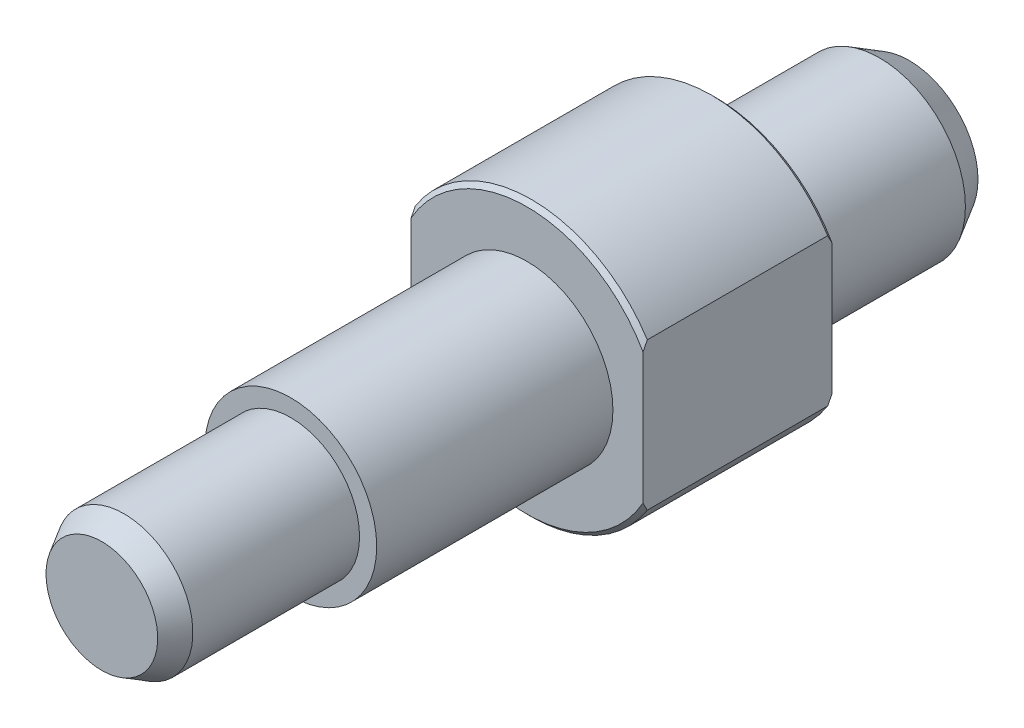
ISO-10303-21;
HEADER;
FILE_DESCRIPTION(('STEP AP214'),'2;1');
FILE_NAME('part.step','',(''),(''),'','','');
FILE_SCHEMA(('AUTOMOTIVE_DESIGN { 1 0 10303 214 1 1 1 1 }'));
ENDSEC;
DATA;
#1=APPLICATION_CONTEXT('core data for automotive mechanical design processes');
#2=APPLICATION_PROTOCOL_DEFINITION('international standard','automotive_design',2000,#1);
#3=PRODUCT_CONTEXT('',#1,'mechanical');
#4=PRODUCT('Part','Part','',(#3));
#5=PRODUCT_RELATED_PRODUCT_CATEGORY('part','',(#4));
#6=PRODUCT_DEFINITION_FORMATION('','',#4);
#7=PRODUCT_DEFINITION_CONTEXT('part definition',#1,'design');
#8=PRODUCT_DEFINITION('design','',#6,#7);
#9=PRODUCT_DEFINITION_SHAPE('','',#8);
#10=(LENGTH_UNIT() NAMED_UNIT(*) SI_UNIT(.MILLI.,.METRE.));
#11=(NAMED_UNIT(*) PLANE_ANGLE_UNIT() SI_UNIT($,.RADIAN.));
#12=(NAMED_UNIT(*) SI_UNIT($,.STERADIAN.) SOLID_ANGLE_UNIT());
#13=UNCERTAINTY_MEASURE_WITH_UNIT(LENGTH_MEASURE(1.E-05),#10,'distance_accuracy_value','');
#14=(GEOMETRIC_REPRESENTATION_CONTEXT(3) GLOBAL_UNCERTAINTY_ASSIGNED_CONTEXT((#13)) GLOBAL_UNIT_ASSIGNED_CONTEXT((#10,
#11,#12)) REPRESENTATION_CONTEXT('',''));
#15=CARTESIAN_POINT('',(0.,0.,0.));
#16=DIRECTION('',(0.,0.,1.));
#17=DIRECTION('',(1.,0.,0.));
#18=AXIS2_PLACEMENT_3D('',#15,#16,#17);
#19=CARTESIAN_POINT('',(0.,0.,0.));
#20=DIRECTION('',(0.,0.,1.));
#21=DIRECTION('',(1.,0.,0.));
#22=AXIS2_PLACEMENT_3D('',#19,#20,#21);
#23=PLANE('',#22);
#24=CARTESIAN_POINT('',(0.,0.,0.));
#25=DIRECTION('',(0.,0.,1.));
#26=DIRECTION('',(1.,0.,0.));
#27=AXIS2_PLACEMENT_3D('',#24,#25,#26);
#28=CIRCLE('',#27,10.);
#29=CARTESIAN_POINT('',(10.,0.,0.));
#30=VERTEX_POINT('',#29);
#31=EDGE_CURVE('E204',#30,#30,#28,.T.);
#32=ORIENTED_EDGE('',*,*,#31,.T.);
#33=EDGE_LOOP('',(#32));
#34=FACE_BOUND('',#33,.T.);
#35=DIRECTION('',(0.,1.,0.));
#36=VECTOR('',#35,1.);
#37=CARTESIAN_POINT('',(13.5,0.,0.));
#38=LINE('',#37,#36);
#39=CARTESIAN_POINT('',(13.5,-7.61577310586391,0.));
#40=VERTEX_POINT('',#39);
#41=CARTESIAN_POINT('',(13.5,7.61577310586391,0.));
#42=VERTEX_POINT('',#41);
#43=EDGE_CURVE('E211',#40,#42,#38,.T.);
#44=ORIENTED_EDGE('',*,*,#43,.F.);
#45=CARTESIAN_POINT('',(0.,0.,0.));
#46=DIRECTION('',(0.,0.,1.));
#47=DIRECTION('',(1.,0.,0.));
#48=AXIS2_PLACEMENT_3D('',#45,#46,#47);
#49=CIRCLE('',#48,15.5);
#50=CARTESIAN_POINT('',(-13.5,-7.61577310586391,0.));
#51=VERTEX_POINT('',#50);
#52=EDGE_CURVE('E401',#40,#51,#49,.F.);
#53=ORIENTED_EDGE('',*,*,#52,.T.);
#54=DIRECTION('',(0.,-1.,0.));
#55=VECTOR('',#54,1.);
#56=CARTESIAN_POINT('',(-13.5,0.,0.));
#57=LINE('',#56,#55);
#58=CARTESIAN_POINT('',(-13.5,7.61577310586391,0.));
#59=VERTEX_POINT('',#58);
#60=EDGE_CURVE('E87',#59,#51,#57,.T.);
#61=ORIENTED_EDGE('',*,*,#60,.F.);
#62=CARTESIAN_POINT('',(0.,0.,0.));
#63=DIRECTION('',(0.,0.,1.));
#64=DIRECTION('',(1.,0.,0.));
#65=AXIS2_PLACEMENT_3D('',#62,#63,#64);
#66=CIRCLE('',#65,15.5);
#67=EDGE_CURVE('E399',#59,#42,#66,.F.);
#68=ORIENTED_EDGE('',*,*,#67,.T.);
#69=EDGE_LOOP('',(#44,#53,#61,#68));
#70=FACE_BOUND('',#69,.T.);
#71=ADVANCED_FACE('F14',(#34,#70),#23,.F.);
#72=CARTESIAN_POINT('',(0.,0.,22.));
#73=DIRECTION('',(0.,0.,-1.));
#74=DIRECTION('',(-1.,0.,0.));
#75=AXIS2_PLACEMENT_3D('',#72,#73,#74);
#76=CYLINDRICAL_SURFACE('',#75,16.);
#77=DIRECTION('',(0.,0.,-1.));
#78=VECTOR('',#77,1.);
#79=CARTESIAN_POINT('',(13.5,8.58778201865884,22.));
#80=LINE('',#79,#78);
#81=CARTESIAN_POINT('',(13.5,8.58778201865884,0.5));
#82=VERTEX_POINT('',#81);
#83=CARTESIAN_POINT('',(13.5,8.58778201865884,21.5));
#84=VERTEX_POINT('',#83);
#85=EDGE_CURVE('E186',#82,#84,#80,.F.);
#86=ORIENTED_EDGE('',*,*,#85,.F.);
#87=CARTESIAN_POINT('',(0.,0.,0.5));
#88=DIRECTION('',(0.,0.,1.));
#89=DIRECTION('',(1.,0.,0.));
#90=AXIS2_PLACEMENT_3D('',#87,#88,#89);
#91=CIRCLE('',#90,16.);
#92=CARTESIAN_POINT('',(-13.5,8.58778201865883,0.5));
#93=VERTEX_POINT('',#92);
#94=EDGE_CURVE('E9',#82,#93,#91,.T.);
#95=ORIENTED_EDGE('',*,*,#94,.T.);
#96=DIRECTION('',(0.,0.,-1.));
#97=VECTOR('',#96,1.);
#98=CARTESIAN_POINT('',(-13.5,8.58778201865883,22.));
#99=LINE('',#98,#97);
#100=CARTESIAN_POINT('',(-13.5,8.58778201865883,21.5));
#101=VERTEX_POINT('',#100);
#102=EDGE_CURVE('E102',#101,#93,#99,.T.);
#103=ORIENTED_EDGE('',*,*,#102,.F.);
#104=CARTESIAN_POINT('',(0.,0.,21.5));
#105=DIRECTION('',(0.,0.,1.));
#106=DIRECTION('',(1.,0.,0.));
#107=AXIS2_PLACEMENT_3D('',#104,#105,#106);
#108=CIRCLE('',#107,16.);
#109=EDGE_CURVE('E23',#101,#84,#108,.F.);
#110=ORIENTED_EDGE('',*,*,#109,.T.);
#111=EDGE_LOOP('',(#86,#95,#103,#110));
#112=FACE_BOUND('',#111,.T.);
#113=ADVANCED_FACE('F185',(#112),#76,.T.);
#114=DIRECTION('',(0.,0.,-1.));
#115=VECTOR('',#114,1.);
#116=CARTESIAN_POINT('',(-13.5,-8.58778201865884,22.));
#117=LINE('',#116,#115);
#118=CARTESIAN_POINT('',(-13.5,-8.58778201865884,0.5));
#119=VERTEX_POINT('',#118);
#120=CARTESIAN_POINT('',(-13.5,-8.58778201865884,21.5));
#121=VERTEX_POINT('',#120);
#122=EDGE_CURVE('E84',#119,#121,#117,.F.);
#123=ORIENTED_EDGE('',*,*,#122,.F.);
#124=CARTESIAN_POINT('',(0.,0.,0.5));
#125=DIRECTION('',(0.,0.,1.));
#126=DIRECTION('',(1.,0.,0.));
#127=AXIS2_PLACEMENT_3D('',#124,#125,#126);
#128=CIRCLE('',#127,16.);
#129=CARTESIAN_POINT('',(13.5,-8.58778201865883,0.5));
#130=VERTEX_POINT('',#129);
#131=EDGE_CURVE('E98',#119,#130,#128,.T.);
#132=ORIENTED_EDGE('',*,*,#131,.T.);
#133=DIRECTION('',(0.,0.,-1.));
#134=VECTOR('',#133,1.);
#135=CARTESIAN_POINT('',(13.5,-8.58778201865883,22.));
#136=LINE('',#135,#134);
#137=CARTESIAN_POINT('',(13.5,-8.58778201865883,21.5));
#138=VERTEX_POINT('',#137);
#139=EDGE_CURVE('E193',#138,#130,#136,.T.);
#140=ORIENTED_EDGE('',*,*,#139,.F.);
#141=CARTESIAN_POINT('',(0.,0.,21.5));
#142=DIRECTION('',(0.,0.,1.));
#143=DIRECTION('',(1.,0.,0.));
#144=AXIS2_PLACEMENT_3D('',#141,#142,#143);
#145=CIRCLE('',#144,16.);
#146=EDGE_CURVE('E101',#138,#121,#145,.F.);
#147=ORIENTED_EDGE('',*,*,#146,.T.);
#148=EDGE_LOOP('',(#123,#132,#140,#147));
#149=FACE_BOUND('',#148,.T.);
#150=ADVANCED_FACE('F96',(#149),#76,.T.);
#151=CARTESIAN_POINT('',(0.,0.,22.));
#152=DIRECTION('',(0.,0.,1.));
#153=DIRECTION('',(1.,0.,0.));
#154=AXIS2_PLACEMENT_3D('',#151,#152,#153);
#155=PLANE('',#154);
#156=CARTESIAN_POINT('',(0.,0.,22.));
#157=DIRECTION('',(0.,0.,1.));
#158=DIRECTION('',(1.,0.,0.));
#159=AXIS2_PLACEMENT_3D('',#156,#157,#158);
#160=CIRCLE('',#159,10.);
#161=CARTESIAN_POINT('',(10.,0.,22.));
#162=VERTEX_POINT('',#161);
#163=EDGE_CURVE('E207',#162,#162,#160,.T.);
#164=ORIENTED_EDGE('',*,*,#163,.F.);
#165=EDGE_LOOP('',(#164));
#166=FACE_BOUND('',#165,.T.);
#167=DIRECTION('',(0.,-1.,0.));
#168=VECTOR('',#167,1.);
#169=CARTESIAN_POINT('',(-13.5,0.,22.));
#170=LINE('',#169,#168);
#171=CARTESIAN_POINT('',(-13.5,7.61577310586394,22.));
#172=VERTEX_POINT('',#171);
#173=CARTESIAN_POINT('',(-13.5,-7.61577310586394,22.));
#174=VERTEX_POINT('',#173);
#175=EDGE_CURVE('E111',#172,#174,#170,.T.);
#176=ORIENTED_EDGE('',*,*,#175,.T.);
#177=CARTESIAN_POINT('',(0.,0.,22.));
#178=DIRECTION('',(0.,0.,1.));
#179=DIRECTION('',(1.,0.,0.));
#180=AXIS2_PLACEMENT_3D('',#177,#178,#179);
#181=CIRCLE('',#180,15.5);
#182=CARTESIAN_POINT('',(13.5,-7.61577310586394,22.));
#183=VERTEX_POINT('',#182);
#184=EDGE_CURVE('E179',#174,#183,#181,.T.);
#185=ORIENTED_EDGE('',*,*,#184,.T.);
#186=DIRECTION('',(0.,1.,0.));
#187=VECTOR('',#186,1.);
#188=CARTESIAN_POINT('',(13.5,0.,22.));
#189=LINE('',#188,#187);
#190=CARTESIAN_POINT('',(13.5,7.61577310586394,22.));
#191=VERTEX_POINT('',#190);
#192=EDGE_CURVE('E200',#183,#191,#189,.T.);
#193=ORIENTED_EDGE('',*,*,#192,.T.);
#194=CARTESIAN_POINT('',(0.,0.,22.));
#195=DIRECTION('',(0.,0.,1.));
#196=DIRECTION('',(1.,0.,0.));
#197=AXIS2_PLACEMENT_3D('',#194,#195,#196);
#198=CIRCLE('',#197,15.5);
#199=EDGE_CURVE('E91',#191,#172,#198,.T.);
#200=ORIENTED_EDGE('',*,*,#199,.T.);
#201=EDGE_LOOP('',(#176,#185,#193,#200));
#202=FACE_BOUND('',#201,.T.);
#203=ADVANCED_FACE('F198',(#166,#202),#155,.T.);
#204=CARTESIAN_POINT('',(0.,0.,0.));
#205=DIRECTION('',(0.,0.,-1.));
#206=DIRECTION('',(-1.,0.,0.));
#207=AXIS2_PLACEMENT_3D('',#204,#205,#206);
#208=CYLINDRICAL_SURFACE('',#207,10.);
#209=CARTESIAN_POINT('',(0.,0.,-19.0358983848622));
#210=DIRECTION('',(0.,0.,1.));
#211=DIRECTION('',(1.,0.,0.));
#212=AXIS2_PLACEMENT_3D('',#209,#210,#211);
#213=CIRCLE('',#212,10.);
#214=CARTESIAN_POINT('',(10.,0.,-19.0358983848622));
#215=VERTEX_POINT('',#214);
#216=EDGE_CURVE('E103',#215,#215,#213,.T.);
#217=ORIENTED_EDGE('',*,*,#216,.T.);
#218=EDGE_LOOP('',(#217));
#219=FACE_BOUND('',#218,.T.);
#220=ORIENTED_EDGE('',*,*,#31,.F.);
#221=EDGE_LOOP('',(#220));
#222=FACE_BOUND('',#221,.T.);
#223=ADVANCED_FACE('F257',(#219,#222),#208,.T.);
#224=CARTESIAN_POINT('',(0.,0.,49.5));
#225=DIRECTION('',(0.,0.,-1.));
#226=DIRECTION('',(-1.,0.,0.));
#227=AXIS2_PLACEMENT_3D('',#224,#225,#226);
#228=CYLINDRICAL_SURFACE('',#227,10.);
#229=CARTESIAN_POINT('',(0.,0.,49.5));
#230=DIRECTION('',(0.,0.,1.));
#231=DIRECTION('',(1.,0.,0.));
#232=AXIS2_PLACEMENT_3D('',#229,#230,#231);
#233=CIRCLE('',#232,10.);
#234=CARTESIAN_POINT('',(10.,0.,49.5));
#235=VERTEX_POINT('',#234);
#236=EDGE_CURVE('E208',#235,#235,#233,.T.);
#237=ORIENTED_EDGE('',*,*,#236,.F.);
#238=EDGE_LOOP('',(#237));
#239=FACE_BOUND('',#238,.T.);
#240=ORIENTED_EDGE('',*,*,#163,.T.);
#241=EDGE_LOOP('',(#240));
#242=FACE_BOUND('',#241,.T.);
#243=ADVANCED_FACE('F254',(#239,#242),#228,.T.);
#244=CARTESIAN_POINT('',(0.,0.,49.5));
#245=DIRECTION('',(0.,0.,1.));
#246=DIRECTION('',(1.,0.,0.));
#247=AXIS2_PLACEMENT_3D('',#244,#245,#246);
#248=PLANE('',#247);
#249=CARTESIAN_POINT('',(0.,0.,49.5));
#250=DIRECTION('',(0.,0.,1.));
#251=DIRECTION('',(1.,0.,0.));
#252=AXIS2_PLACEMENT_3D('',#249,#250,#251);
#253=CIRCLE('',#252,8.);
#254=CARTESIAN_POINT('',(8.,0.,49.5));
#255=VERTEX_POINT('',#254);
#256=EDGE_CURVE('E201',#255,#255,#253,.T.);
#257=ORIENTED_EDGE('',*,*,#256,.F.);
#258=EDGE_LOOP('',(#257));
#259=FACE_BOUND('',#258,.T.);
#260=ORIENTED_EDGE('',*,*,#236,.T.);
#261=EDGE_LOOP('',(#260));
#262=FACE_BOUND('',#261,.T.);
#263=ADVANCED_FACE('F265',(#259,#262),#248,.T.);
#264=CARTESIAN_POINT('',(0.,0.,71.5));
#265=DIRECTION('',(0.,0.,-1.));
#266=DIRECTION('',(-1.,0.,0.));
#267=AXIS2_PLACEMENT_3D('',#264,#265,#266);
#268=CYLINDRICAL_SURFACE('',#267,8.);
#269=CARTESIAN_POINT('',(0.,0.,68.9019237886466));
#270=DIRECTION('',(0.,0.,-1.));
#271=DIRECTION('',(-1.,0.,0.));
#272=AXIS2_PLACEMENT_3D('',#269,#270,#271);
#273=CIRCLE('',#272,8.);
#274=CARTESIAN_POINT('',(-8.,0.,68.9019237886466));
#275=VERTEX_POINT('',#274);
#276=EDGE_CURVE('E225',#275,#275,#273,.T.);
#277=ORIENTED_EDGE('',*,*,#276,.T.);
#278=EDGE_LOOP('',(#277));
#279=FACE_BOUND('',#278,.T.);
#280=ORIENTED_EDGE('',*,*,#256,.T.);
#281=EDGE_LOOP('',(#280));
#282=FACE_BOUND('',#281,.T.);
#283=ADVANCED_FACE('F130',(#279,#282),#268,.T.);
#284=CARTESIAN_POINT('',(13.5,17.8991869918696,71.5));
#285=DIRECTION('',(1.,0.,0.));
#286=DIRECTION('',(0.,1.,0.));
#287=AXIS2_PLACEMENT_3D('',#284,#285,#286);
#288=PLANE('',#287);
#289=ORIENTED_EDGE('',*,*,#139,.T.);
#290=CARTESIAN_POINT('',(13.5,-8.58778201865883,0.5));
#291=CARTESIAN_POINT('',(13.5,-8.50751562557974,0.456918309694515));
#292=CARTESIAN_POINT('',(13.5,-8.42706999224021,0.414170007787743));
#293=CARTESIAN_POINT('',(13.5,-8.2658189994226,0.329373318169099));
#294=CARTESIAN_POINT('',(13.5,-8.18501366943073,0.287324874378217));
#295=CARTESIAN_POINT('',(13.5,-8.02302878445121,0.203953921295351));
#296=CARTESIAN_POINT('',(13.5,-7.94184922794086,0.162631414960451));
#297=CARTESIAN_POINT('',(13.5,-7.77910228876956,0.0807409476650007));
#298=CARTESIAN_POINT('',(13.5,-7.69753487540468,0.040173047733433));
#299=CARTESIAN_POINT('',(13.5,-7.61577310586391,0.));
#300=B_SPLINE_CURVE_WITH_KNOTS('',3,(#290,#291,#292,#293,#294,#295,#296,#297,#298,#299),
.UNSPECIFIED.,.F.,.F.,(4,2,2,2,4),(0.,0.27329162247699,0.54656123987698,0.819831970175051,
1.0931247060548),.UNSPECIFIED.);
#301=EDGE_CURVE('E106',#130,#40,#300,.T.);
#302=ORIENTED_EDGE('',*,*,#301,.T.);
#303=ORIENTED_EDGE('',*,*,#43,.T.);
#304=CARTESIAN_POINT('',(13.5,7.61577310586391,0.));
#305=CARTESIAN_POINT('',(13.5,7.69753487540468,0.0401730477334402));
#306=CARTESIAN_POINT('',(13.5,7.77910228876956,0.0807409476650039));
#307=CARTESIAN_POINT('',(13.5,7.94184922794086,0.16263141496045));
#308=CARTESIAN_POINT('',(13.5,8.02302878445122,0.20395392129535));
#309=CARTESIAN_POINT('',(13.5,8.18501366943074,0.287324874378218));
#310=CARTESIAN_POINT('',(13.5,8.2658189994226,0.329373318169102));
#311=CARTESIAN_POINT('',(13.5,8.42706999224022,0.414170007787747));
#312=CARTESIAN_POINT('',(13.5,8.50751562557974,0.456918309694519));
#313=CARTESIAN_POINT('',(13.5,8.58778201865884,0.5));
#314=B_SPLINE_CURVE_WITH_KNOTS('',3,(#304,#305,#306,#307,#308,#309,#310,#311,#312,#313),
.UNSPECIFIED.,.F.,.F.,(4,2,2,2,4),(0.,0.27329273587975,0.546563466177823,0.819833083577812,
1.0931247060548),.UNSPECIFIED.);
#315=EDGE_CURVE('E109',#42,#82,#314,.T.);
#316=ORIENTED_EDGE('',*,*,#315,.T.);
#317=ORIENTED_EDGE('',*,*,#85,.T.);
#318=CARTESIAN_POINT('',(13.5,8.58778201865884,21.5));
#319=CARTESIAN_POINT('',(13.5,8.50751562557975,21.5430816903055));
#320=CARTESIAN_POINT('',(13.5,8.42706999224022,21.5858299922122));
#321=CARTESIAN_POINT('',(13.5,8.26581899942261,21.6706266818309));
#322=CARTESIAN_POINT('',(13.5,8.18501366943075,21.7126751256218));
#323=CARTESIAN_POINT('',(13.5,8.02302878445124,21.7960460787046));
#324=CARTESIAN_POINT('',(13.5,7.94184922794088,21.8373685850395));
#325=CARTESIAN_POINT('',(13.5,7.77910228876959,21.919259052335));
#326=CARTESIAN_POINT('',(13.5,7.69753487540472,21.9598269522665));
#327=CARTESIAN_POINT('',(13.5,7.61577310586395,22.));
#328=B_SPLINE_CURVE_WITH_KNOTS('',3,(#318,#319,#320,#321,#322,#323,#324,#325,#326,#327),
.UNSPECIFIED.,.F.,.F.,(4,2,2,2,4),(0.,0.273291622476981,0.546561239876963,0.819831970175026,
1.09312470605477),.UNSPECIFIED.);
#329=EDGE_CURVE('E107',#84,#191,#328,.T.);
#330=ORIENTED_EDGE('',*,*,#329,.T.);
#331=ORIENTED_EDGE('',*,*,#192,.F.);
#332=CARTESIAN_POINT('',(13.5,-7.61577310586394,22.));
#333=CARTESIAN_POINT('',(13.5,-7.69753487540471,21.9598269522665));
#334=CARTESIAN_POINT('',(13.5,-7.77910228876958,21.919259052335));
#335=CARTESIAN_POINT('',(13.5,-7.94184922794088,21.8373685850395));
#336=CARTESIAN_POINT('',(13.5,-8.02302878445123,21.7960460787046));
#337=CARTESIAN_POINT('',(13.5,-8.18501366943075,21.7126751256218));
#338=CARTESIAN_POINT('',(13.5,-8.26581899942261,21.6706266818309));
#339=CARTESIAN_POINT('',(13.5,-8.42706999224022,21.5858299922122));
#340=CARTESIAN_POINT('',(13.5,-8.50751562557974,21.5430816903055));
#341=CARTESIAN_POINT('',(13.5,-8.58778201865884,21.5));
#342=B_SPLINE_CURVE_WITH_KNOTS('',3,(#332,#333,#334,#335,#336,#337,#338,#339,#340,#341),
.UNSPECIFIED.,.F.,.F.,(4,2,2,2,4),(0.,0.273292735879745,0.546563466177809,0.819833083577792,
1.09312470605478),.UNSPECIFIED.);
#343=EDGE_CURVE('E140',#183,#138,#342,.T.);
#344=ORIENTED_EDGE('',*,*,#343,.T.);
#345=EDGE_LOOP('',(#289,#302,#303,#316,#317,#330,#331,#344));
#346=FACE_BOUND('',#345,.T.);
#347=ADVANCED_FACE('F125',(#346),#288,.T.);
#348=CARTESIAN_POINT('',(-13.5,17.8991869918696,71.5));
#349=DIRECTION('',(-1.,0.,0.));
#350=DIRECTION('',(0.,-1.,0.));
#351=AXIS2_PLACEMENT_3D('',#348,#349,#350);
#352=PLANE('',#351);
#353=ORIENTED_EDGE('',*,*,#60,.T.);
#354=CARTESIAN_POINT('',(-13.5,-7.61577310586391,0.));
#355=CARTESIAN_POINT('',(-13.5,-7.69753487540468,0.0401730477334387));
#356=CARTESIAN_POINT('',(-13.5,-7.77910228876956,0.0807409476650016));
#357=CARTESIAN_POINT('',(-13.5,-7.94184922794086,0.162631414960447));
#358=CARTESIAN_POINT('',(-13.5,-8.02302878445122,0.203953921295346));
#359=CARTESIAN_POINT('',(-13.5,-8.18501366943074,0.287324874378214));
#360=CARTESIAN_POINT('',(-13.5,-8.2658189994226,0.329373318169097));
#361=CARTESIAN_POINT('',(-13.5,-8.42706999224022,0.414170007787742));
#362=CARTESIAN_POINT('',(-13.5,-8.50751562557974,0.456918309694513));
#363=CARTESIAN_POINT('',(-13.5,-8.58778201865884,0.499999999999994));
#364=B_SPLINE_CURVE_WITH_KNOTS('',3,(#354,#355,#356,#357,#358,#359,#360,#361,#362,#363),
.UNSPECIFIED.,.F.,.F.,(4,2,2,2,4),(0.,0.273292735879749,0.546563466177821,0.81983308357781,
1.0931247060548),.UNSPECIFIED.);
#365=EDGE_CURVE('E81',#51,#119,#364,.T.);
#366=ORIENTED_EDGE('',*,*,#365,.T.);
#367=ORIENTED_EDGE('',*,*,#122,.T.);
#368=CARTESIAN_POINT('',(-13.5,-8.58778201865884,21.5));
#369=CARTESIAN_POINT('',(-13.5,-8.50751562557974,21.5430816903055));
#370=CARTESIAN_POINT('',(-13.5,-8.42706999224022,21.5858299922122));
#371=CARTESIAN_POINT('',(-13.5,-8.26581899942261,21.6706266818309));
#372=CARTESIAN_POINT('',(-13.5,-8.18501366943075,21.7126751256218));
#373=CARTESIAN_POINT('',(-13.5,-8.02302878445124,21.7960460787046));
#374=CARTESIAN_POINT('',(-13.5,-7.94184922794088,21.8373685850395));
#375=CARTESIAN_POINT('',(-13.5,-7.77910228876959,21.919259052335));
#376=CARTESIAN_POINT('',(-13.5,-7.69753487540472,21.9598269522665));
#377=CARTESIAN_POINT('',(-13.5,-7.61577310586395,22.));
#378=B_SPLINE_CURVE_WITH_KNOTS('',3,(#368,#369,#370,#371,#372,#373,#374,#375,#376,#377),
.UNSPECIFIED.,.F.,.F.,(4,2,2,2,4),(0.,0.273291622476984,0.546561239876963,0.819831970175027,
1.09312470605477),.UNSPECIFIED.);
#379=EDGE_CURVE('E92',#121,#174,#378,.T.);
#380=ORIENTED_EDGE('',*,*,#379,.T.);
#381=ORIENTED_EDGE('',*,*,#175,.F.);
#382=CARTESIAN_POINT('',(-13.5,7.61577310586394,22.));
#383=CARTESIAN_POINT('',(-13.5,7.69753487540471,21.9598269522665));
#384=CARTESIAN_POINT('',(-13.5,7.77910228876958,21.919259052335));
#385=CARTESIAN_POINT('',(-13.5,7.94184922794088,21.8373685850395));
#386=CARTESIAN_POINT('',(-13.5,8.02302878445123,21.7960460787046));
#387=CARTESIAN_POINT('',(-13.5,8.18501366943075,21.7126751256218));
#388=CARTESIAN_POINT('',(-13.5,8.26581899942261,21.6706266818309));
#389=CARTESIAN_POINT('',(-13.5,8.42706999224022,21.5858299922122));
#390=CARTESIAN_POINT('',(-13.5,8.50751562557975,21.5430816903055));
#391=CARTESIAN_POINT('',(-13.5,8.58778201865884,21.5));
#392=B_SPLINE_CURVE_WITH_KNOTS('',3,(#382,#383,#384,#385,#386,#387,#388,#389,#390,#391),
.UNSPECIFIED.,.F.,.F.,(4,2,2,2,4),(0.,0.273292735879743,0.546563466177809,0.819833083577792,
1.09312470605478),.UNSPECIFIED.);
#393=EDGE_CURVE('E37',#172,#101,#392,.T.);
#394=ORIENTED_EDGE('',*,*,#393,.T.);
#395=ORIENTED_EDGE('',*,*,#102,.T.);
#396=CARTESIAN_POINT('',(-13.5,8.58778201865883,0.5));
#397=CARTESIAN_POINT('',(-13.5,8.50751562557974,0.456918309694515));
#398=CARTESIAN_POINT('',(-13.5,8.42706999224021,0.414170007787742));
#399=CARTESIAN_POINT('',(-13.5,8.2658189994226,0.329373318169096));
#400=CARTESIAN_POINT('',(-13.5,8.18501366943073,0.287324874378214));
#401=CARTESIAN_POINT('',(-13.5,8.02302878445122,0.203953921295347));
#402=CARTESIAN_POINT('',(-13.5,7.94184922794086,0.162631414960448));
#403=CARTESIAN_POINT('',(-13.5,7.77910228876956,0.0807409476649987));
#404=CARTESIAN_POINT('',(-13.5,7.69753487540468,0.0401730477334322));
#405=CARTESIAN_POINT('',(-13.5,7.61577310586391,0.));
#406=B_SPLINE_CURVE_WITH_KNOTS('',3,(#396,#397,#398,#399,#400,#401,#402,#403,#404,#405),
.UNSPECIFIED.,.F.,.F.,(4,2,2,2,4),(0.,0.273291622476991,0.54656123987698,0.819831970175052,
1.0931247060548),.UNSPECIFIED.);
#407=EDGE_CURVE('E30',#93,#59,#406,.T.);
#408=ORIENTED_EDGE('',*,*,#407,.T.);
#409=EDGE_LOOP('',(#353,#366,#367,#380,#381,#394,#395,#408));
#410=FACE_BOUND('',#409,.T.);
#411=ADVANCED_FACE('F83',(#410),#352,.T.);
#412=CARTESIAN_POINT('',(0.,0.,0.5));
#413=DIRECTION('',(0.,0.,1.));
#414=DIRECTION('',(1.,0.,0.));
#415=AXIS2_PLACEMENT_3D('',#412,#413,#414);
#416=CONICAL_SURFACE('',#415,16.,0.785398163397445);
#417=ORIENTED_EDGE('',*,*,#365,.F.);
#418=ORIENTED_EDGE('',*,*,#52,.F.);
#419=ORIENTED_EDGE('',*,*,#301,.F.);
#420=ORIENTED_EDGE('',*,*,#131,.F.);
#421=EDGE_LOOP('',(#417,#418,#419,#420));
#422=FACE_BOUND('',#421,.T.);
#423=ADVANCED_FACE('F105',(#422),#416,.T.);
#424=CARTESIAN_POINT('',(0.,0.,22.));
#425=DIRECTION('',(0.,0.,-1.));
#426=DIRECTION('',(-1.,0.,0.));
#427=AXIS2_PLACEMENT_3D('',#424,#425,#426);
#428=CONICAL_SURFACE('',#427,15.5,0.785398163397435);
#429=ORIENTED_EDGE('',*,*,#379,.F.);
#430=ORIENTED_EDGE('',*,*,#146,.F.);
#431=ORIENTED_EDGE('',*,*,#343,.F.);
#432=ORIENTED_EDGE('',*,*,#184,.F.);
#433=EDGE_LOOP('',(#429,#430,#431,#432));
#434=FACE_BOUND('',#433,.T.);
#435=ADVANCED_FACE('F152',(#434),#428,.T.);
#436=CARTESIAN_POINT('',(0.,0.,0.5));
#437=DIRECTION('',(0.,0.,1.));
#438=DIRECTION('',(1.,0.,0.));
#439=AXIS2_PLACEMENT_3D('',#436,#437,#438);
#440=CONICAL_SURFACE('',#439,16.,0.785398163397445);
#441=ORIENTED_EDGE('',*,*,#315,.F.);
#442=ORIENTED_EDGE('',*,*,#67,.F.);
#443=ORIENTED_EDGE('',*,*,#407,.F.);
#444=ORIENTED_EDGE('',*,*,#94,.F.);
#445=EDGE_LOOP('',(#441,#442,#443,#444));
#446=FACE_BOUND('',#445,.T.);
#447=ADVANCED_FACE('F155',(#446),#440,.T.);
#448=CARTESIAN_POINT('',(0.,0.,22.));
#449=DIRECTION('',(0.,0.,-1.));
#450=DIRECTION('',(-1.,0.,0.));
#451=AXIS2_PLACEMENT_3D('',#448,#449,#450);
#452=CONICAL_SURFACE('',#451,15.5,0.785398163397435);
#453=ORIENTED_EDGE('',*,*,#329,.F.);
#454=ORIENTED_EDGE('',*,*,#109,.F.);
#455=ORIENTED_EDGE('',*,*,#393,.F.);
#456=ORIENTED_EDGE('',*,*,#199,.F.);
#457=EDGE_LOOP('',(#453,#454,#455,#456));
#458=FACE_BOUND('',#457,.T.);
#459=ADVANCED_FACE('F16',(#458),#452,.T.);
#460=CARTESIAN_POINT('',(0.,0.,-14.0116653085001));
#461=DIRECTION('',(0.,0.,1.));
#462=DIRECTION('',(1.,0.,0.));
#463=AXIS2_PLACEMENT_3D('',#460,#461,#462);
#464=CONICAL_SURFACE('',#463,12.900742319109,0.523598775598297);
#465=CARTESIAN_POINT('',(0.,0.,-22.5));
#466=DIRECTION('',(0.,0.,-1.));
#467=DIRECTION('',(-1.,0.,0.));
#468=AXIS2_PLACEMENT_3D('',#465,#466,#467);
#469=CIRCLE('',#468,8.);
#470=CARTESIAN_POINT('',(-8.,0.,-22.5));
#471=VERTEX_POINT('',#470);
#472=EDGE_CURVE('E222',#471,#471,#469,.T.);
#473=ORIENTED_EDGE('',*,*,#472,.F.);
#474=EDGE_LOOP('',(#473));
#475=FACE_BOUND('',#474,.T.);
#476=ORIENTED_EDGE('',*,*,#216,.F.);
#477=EDGE_LOOP('',(#476));
#478=FACE_BOUND('',#477,.T.);
#479=ADVANCED_FACE('F261',(#475,#478),#464,.T.);
#480=CARTESIAN_POINT('',(0.,0.,-22.5));
#481=DIRECTION('',(0.,0.,1.));
#482=DIRECTION('',(1.,0.,0.));
#483=AXIS2_PLACEMENT_3D('',#480,#481,#482);
#484=PLANE('',#483);
#485=ORIENTED_EDGE('',*,*,#472,.T.);
#486=EDGE_LOOP('',(#485));
#487=FACE_BOUND('',#486,.T.);
#488=ADVANCED_FACE('F241',(#487),#484,.F.);
#489=CARTESIAN_POINT('',(0.,0.,71.5));
#490=DIRECTION('',(0.,0.,-1.));
#491=DIRECTION('',(-1.,0.,0.));
#492=AXIS2_PLACEMENT_3D('',#489,#490,#491);
#493=CONICAL_SURFACE('',#492,6.5,0.523598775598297);
#494=CARTESIAN_POINT('',(0.,0.,71.5));
#495=DIRECTION('',(0.,0.,-1.));
#496=DIRECTION('',(-1.,0.,0.));
#497=AXIS2_PLACEMENT_3D('',#494,#495,#496);
#498=CIRCLE('',#497,6.5);
#499=CARTESIAN_POINT('',(-6.5,0.,71.5));
#500=VERTEX_POINT('',#499);
#501=EDGE_CURVE('E228',#500,#500,#498,.T.);
#502=ORIENTED_EDGE('',*,*,#501,.T.);
#503=EDGE_LOOP('',(#502));
#504=FACE_BOUND('',#503,.T.);
#505=ORIENTED_EDGE('',*,*,#276,.F.);
#506=EDGE_LOOP('',(#505));
#507=FACE_BOUND('',#506,.T.);
#508=ADVANCED_FACE('F232',(#504,#507),#493,.T.);
#509=CARTESIAN_POINT('',(0.,0.,71.5));
#510=DIRECTION('',(0.,0.,1.));
#511=DIRECTION('',(1.,0.,0.));
#512=AXIS2_PLACEMENT_3D('',#509,#510,#511);
#513=PLANE('',#512);
#514=ORIENTED_EDGE('',*,*,#501,.F.);
#515=EDGE_LOOP('',(#514));
#516=FACE_BOUND('',#515,.T.);
#517=ADVANCED_FACE('F134',(#516),#513,.T.);
#518=CLOSED_SHELL('',(#71,#113,#150,#203,#223,#243,#263,#283,#347,#411,#423,#435,#447,#459,#479,
#488,#508,#517));
#519=MANIFOLD_SOLID_BREP('B1',#518);
#520=ADVANCED_BREP_SHAPE_REPRESENTATION('',(#18,#519),#14);
#521=SHAPE_DEFINITION_REPRESENTATION(#9,#520);
ENDSEC;
END-ISO-10303-21;
